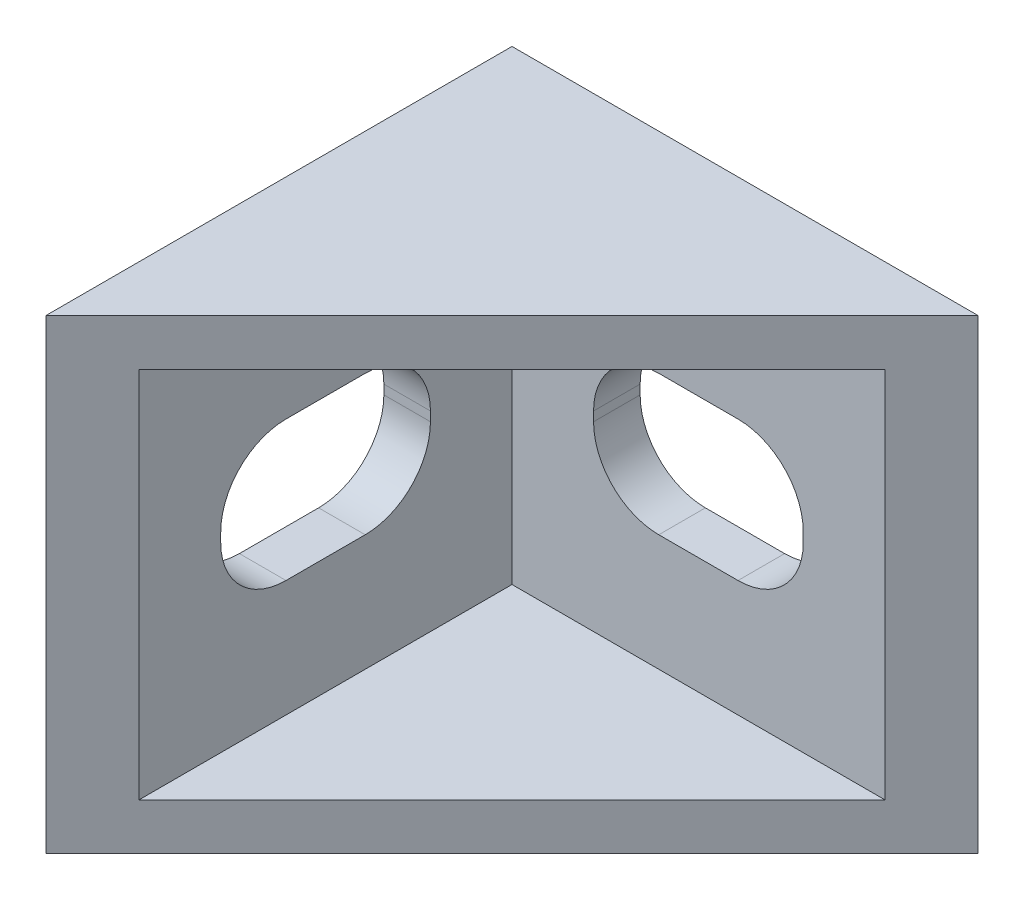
from build123d import *

# Parameters (mm, degrees)
SALIENTE_EXTRUIR1_DEPTH = 20
VACIADO1_T              = -2
CORTAR_EXTRUIR1_DEPTH   = 10
CORTAR_EXTRUIR2_DEPTH   = 10


with BuildPart() as part:
    # Croquis1 → Saliente-Extruir1 (new body)
    with BuildSketch(Plane(origin=(0, 0, 0), x_dir=(1, 0, 0), z_dir=(0, 1, 0))):
        Polygon((0, -20), (20, 0), (0, 0), align=None)
    extrude(amount=SALIENTE_EXTRUIR1_DEPTH)

    # Vaciado1
    vaciado1_openings = [part.faces().sort_by_distance(p)[0] for p in [
        (10, 10, 10),
    ]]
    offset(amount=VACIADO1_T, openings=vaciado1_openings, kind=Kind.INTERSECTION)

    # Croquis2 → Cortar-Extruir1 (cut)
    with BuildSketch(Plane(origin=(2, 0, 0), x_dir=(0, 0, -1), z_dir=(1, 0, 0))):
        with BuildLine():
            Line((-11.7, 7), (-8.3, 7))
            ThreePointArc((-8.3, 7), (-6.320101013, 7.820101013), (-5.5, 9.8))
            Line((-5.5, 9.8), (-5.5, 10.2))
            ThreePointArc((-5.5, 10.2), (-6.320101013, 12.179898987), (-8.3, 13))
            Line((-8.3, 13), (-11.7, 13))
            ThreePointArc((-11.7, 13), (-13.679898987, 12.179898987), (-14.5, 10.2))
            Line((-14.5, 10.2), (-14.5, 9.8))
            ThreePointArc((-14.5, 9.8), (-13.679898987, 7.820101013), (-11.7, 7))
        make_face()
    extrude(amount=-CORTAR_EXTRUIR1_DEPTH, mode=Mode.SUBTRACT)

    # Croquis3 → Cortar-Extruir2 (cut)
    with BuildSketch(Plane.XY.offset(2)):
        with BuildLine():
            Line((8.3, 7), (11.7, 7))
            ThreePointArc((11.7, 7), (13.679898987, 7.820101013), (14.5, 9.8))
            Line((14.5, 9.8), (14.5, 10.2))
            ThreePointArc((14.5, 10.2), (13.679898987, 12.179898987), (11.7, 13))
            Line((11.7, 13), (8.3, 13))
            ThreePointArc((8.3, 13), (6.320101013, 12.179898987), (5.5, 10.2))
            Line((5.5, 10.2), (5.5, 9.8))
            ThreePointArc((5.5, 9.8), (6.320101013, 7.820101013), (8.3, 7))
        make_face()
    extrude(amount=-CORTAR_EXTRUIR2_DEPTH, mode=Mode.SUBTRACT)


solid = part.part
